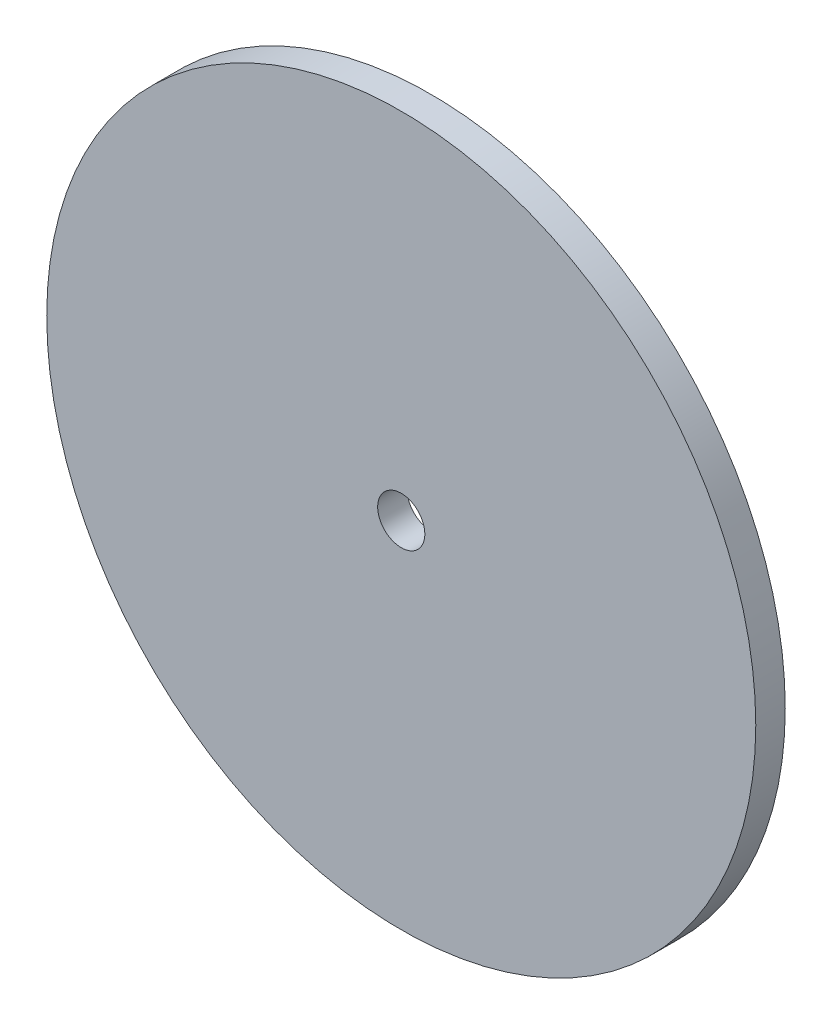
ISO-10303-21;
HEADER;
FILE_DESCRIPTION(('STEP AP214'),'2;1');
FILE_NAME('part.step','',(''),(''),'','','');
FILE_SCHEMA(('AUTOMOTIVE_DESIGN { 1 0 10303 214 1 1 1 1 }'));
ENDSEC;
DATA;
#1=APPLICATION_CONTEXT('core data for automotive mechanical design processes');
#2=APPLICATION_PROTOCOL_DEFINITION('international standard','automotive_design',2000,#1);
#3=PRODUCT_CONTEXT('',#1,'mechanical');
#4=PRODUCT('Part','Part','',(#3));
#5=PRODUCT_RELATED_PRODUCT_CATEGORY('part','',(#4));
#6=PRODUCT_DEFINITION_FORMATION('','',#4);
#7=PRODUCT_DEFINITION_CONTEXT('part definition',#1,'design');
#8=PRODUCT_DEFINITION('design','',#6,#7);
#9=PRODUCT_DEFINITION_SHAPE('','',#8);
#10=(LENGTH_UNIT() NAMED_UNIT(*) SI_UNIT(.MILLI.,.METRE.));
#11=(NAMED_UNIT(*) PLANE_ANGLE_UNIT() SI_UNIT($,.RADIAN.));
#12=(NAMED_UNIT(*) SI_UNIT($,.STERADIAN.) SOLID_ANGLE_UNIT());
#13=UNCERTAINTY_MEASURE_WITH_UNIT(LENGTH_MEASURE(1.E-05),#10,'distance_accuracy_value','');
#14=(GEOMETRIC_REPRESENTATION_CONTEXT(3) GLOBAL_UNCERTAINTY_ASSIGNED_CONTEXT((#13)) GLOBAL_UNIT_ASSIGNED_CONTEXT((#10,
#11,#12)) REPRESENTATION_CONTEXT('',''));
#15=CARTESIAN_POINT('',(0.,0.,0.));
#16=DIRECTION('',(0.,0.,1.));
#17=DIRECTION('',(1.,0.,0.));
#18=AXIS2_PLACEMENT_3D('',#15,#16,#17);
#19=CARTESIAN_POINT('',(0.,0.,5.));
#20=DIRECTION('',(0.,0.,1.));
#21=DIRECTION('',(1.,0.,0.));
#22=AXIS2_PLACEMENT_3D('',#19,#20,#21);
#23=PLANE('',#22);
#24=CARTESIAN_POINT('',(0.,0.,5.));
#25=DIRECTION('',(0.,0.,1.));
#26=DIRECTION('',(1.,0.,0.));
#27=AXIS2_PLACEMENT_3D('',#24,#25,#26);
#28=CIRCLE('',#27,60.15);
#29=CARTESIAN_POINT('',(60.15,0.,5.));
#30=VERTEX_POINT('',#29);
#31=EDGE_CURVE('E10',#30,#30,#28,.T.);
#32=ORIENTED_EDGE('',*,*,#31,.T.);
#33=EDGE_LOOP('',(#32));
#34=FACE_BOUND('',#33,.T.);
#35=CARTESIAN_POINT('',(0.,0.,5.));
#36=DIRECTION('',(0.,0.,1.));
#37=DIRECTION('',(1.,0.,0.));
#38=AXIS2_PLACEMENT_3D('',#35,#36,#37);
#39=CIRCLE('',#38,4.);
#40=CARTESIAN_POINT('',(4.,0.,5.));
#41=VERTEX_POINT('',#40);
#42=EDGE_CURVE('E45',#41,#41,#39,.T.);
#43=ORIENTED_EDGE('',*,*,#42,.F.);
#44=EDGE_LOOP('',(#43));
#45=FACE_BOUND('',#44,.T.);
#46=ADVANCED_FACE('F34',(#34,#45),#23,.T.);
#47=CARTESIAN_POINT('',(0.,0.,0.));
#48=DIRECTION('',(0.,0.,1.));
#49=DIRECTION('',(1.,0.,0.));
#50=AXIS2_PLACEMENT_3D('',#47,#48,#49);
#51=PLANE('',#50);
#52=CARTESIAN_POINT('',(0.,0.,0.));
#53=DIRECTION('',(0.,0.,1.));
#54=DIRECTION('',(1.,0.,0.));
#55=AXIS2_PLACEMENT_3D('',#52,#53,#54);
#56=CIRCLE('',#55,60.15);
#57=CARTESIAN_POINT('',(60.15,0.,0.));
#58=VERTEX_POINT('',#57);
#59=EDGE_CURVE('E38',#58,#58,#56,.T.);
#60=ORIENTED_EDGE('',*,*,#59,.F.);
#61=EDGE_LOOP('',(#60));
#62=FACE_BOUND('',#61,.T.);
#63=CARTESIAN_POINT('',(0.,0.,0.));
#64=DIRECTION('',(0.,0.,1.));
#65=DIRECTION('',(1.,0.,0.));
#66=AXIS2_PLACEMENT_3D('',#63,#64,#65);
#67=CIRCLE('',#66,4.);
#68=CARTESIAN_POINT('',(4.,0.,0.));
#69=VERTEX_POINT('',#68);
#70=EDGE_CURVE('E47',#69,#69,#67,.T.);
#71=ORIENTED_EDGE('',*,*,#70,.T.);
#72=EDGE_LOOP('',(#71));
#73=FACE_BOUND('',#72,.T.);
#74=ADVANCED_FACE('F57',(#62,#73),#51,.F.);
#75=CARTESIAN_POINT('',(0.,0.,5.));
#76=DIRECTION('',(0.,0.,-1.));
#77=DIRECTION('',(-1.,0.,0.));
#78=AXIS2_PLACEMENT_3D('',#75,#76,#77);
#79=CYLINDRICAL_SURFACE('',#78,60.15);
#80=ORIENTED_EDGE('',*,*,#31,.F.);
#81=EDGE_LOOP('',(#80));
#82=FACE_BOUND('',#81,.T.);
#83=ORIENTED_EDGE('',*,*,#59,.T.);
#84=EDGE_LOOP('',(#83));
#85=FACE_BOUND('',#84,.T.);
#86=ADVANCED_FACE('F36',(#82,#85),#79,.T.);
#87=CARTESIAN_POINT('',(0.,0.,5.));
#88=DIRECTION('',(0.,0.,-1.));
#89=DIRECTION('',(-1.,0.,0.));
#90=AXIS2_PLACEMENT_3D('',#87,#88,#89);
#91=CYLINDRICAL_SURFACE('',#90,4.);
#92=ORIENTED_EDGE('',*,*,#42,.T.);
#93=EDGE_LOOP('',(#92));
#94=FACE_BOUND('',#93,.T.);
#95=ORIENTED_EDGE('',*,*,#70,.F.);
#96=EDGE_LOOP('',(#95));
#97=FACE_BOUND('',#96,.T.);
#98=ADVANCED_FACE('F53',(#94,#97),#91,.F.);
#99=CLOSED_SHELL('',(#46,#74,#86,#98));
#100=MANIFOLD_SOLID_BREP('B2',#99);
#101=ADVANCED_BREP_SHAPE_REPRESENTATION('',(#18,#100),#14);
#102=SHAPE_DEFINITION_REPRESENTATION(#9,#101);
ENDSEC;
END-ISO-10303-21;
